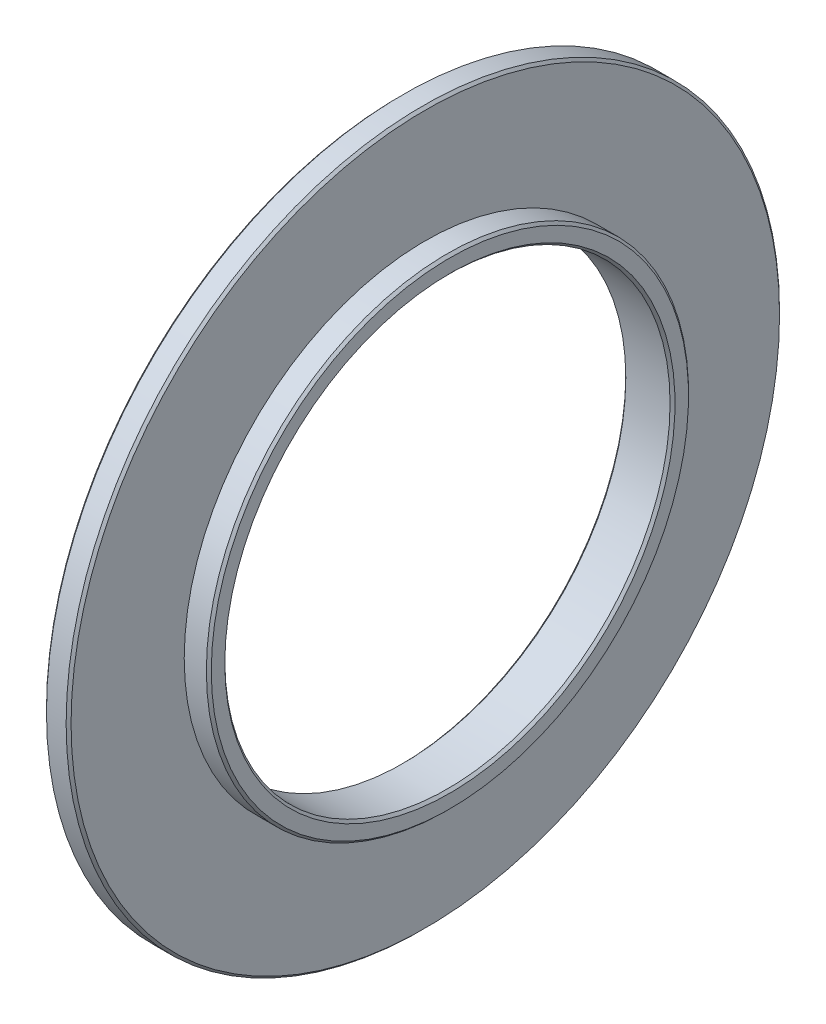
from build123d import *

# Parameters (mm, degrees)
CHANFREIN1_SIZE = 0.5


with BuildPart() as part:
    # Esquisse1 → R_volution1 (revolve)
    with BuildSketch(Plane.XY, mode=Mode.PRIVATE) as r_volution1_sk:
        Polygon((0, 72.5), (0, 45.25), (10, 45.25), (10, 49), (5, 49), (5, 72.5), align=None)
    revolve(r_volution1_sk.sketch.rotate(Axis((0, 0, 0), (1, 0, 0)), 90), axis=Axis((0, 0, 0), (1, 0, 0)))

    # Chanfrein1
    chanfrein1_edges = [part.edges().sort_by_distance(p)[0] for p in [
        (0, 0, -72.5),
        (0, 0, -45.25),
        (10, 0, -45.25),
        (10, 0, -49),
        (5, 0, -72.5),
    ]]
    chamfer(chanfrein1_edges, length=CHANFREIN1_SIZE)


solid = part.part
